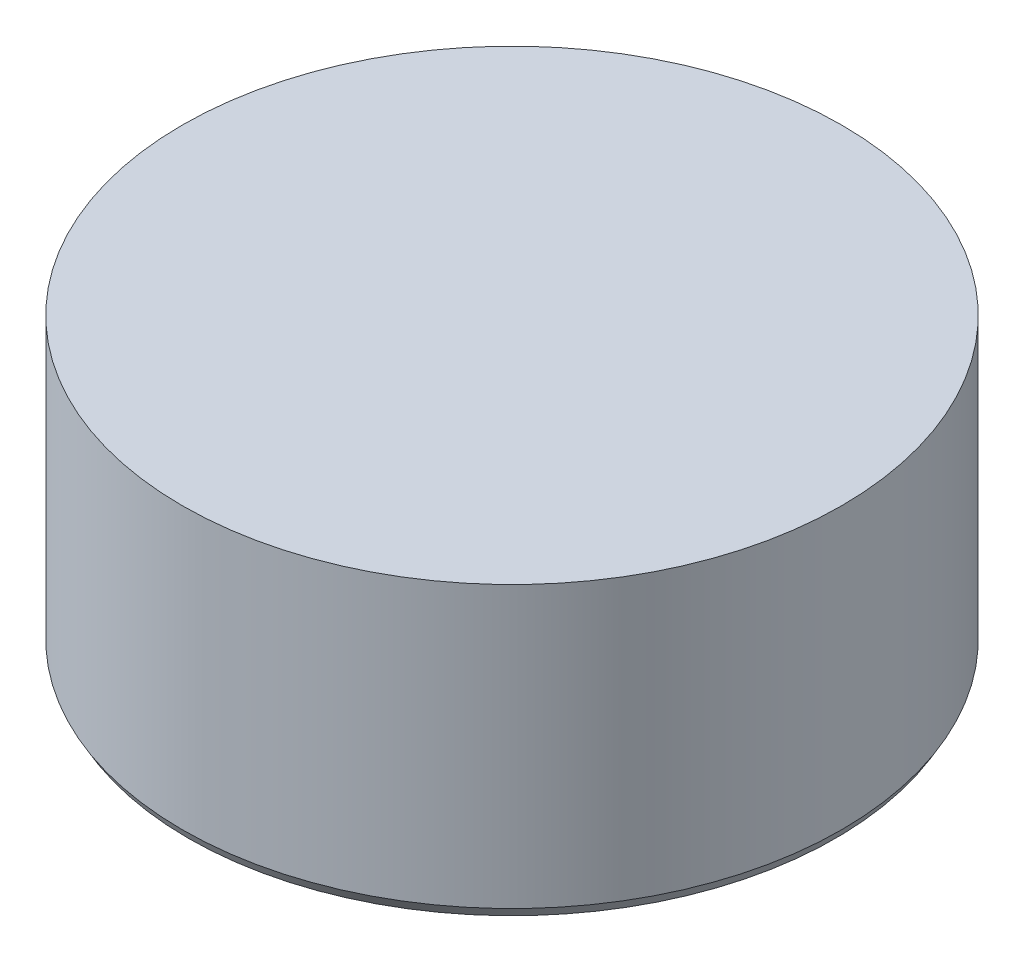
ISO-10303-21;
HEADER;
FILE_DESCRIPTION(('STEP AP214'),'2;1');
FILE_NAME('part.step','',(''),(''),'','','');
FILE_SCHEMA(('AUTOMOTIVE_DESIGN { 1 0 10303 214 1 1 1 1 }'));
ENDSEC;
DATA;
#1=APPLICATION_CONTEXT('core data for automotive mechanical design processes');
#2=APPLICATION_PROTOCOL_DEFINITION('international standard','automotive_design',2000,#1);
#3=PRODUCT_CONTEXT('',#1,'mechanical');
#4=PRODUCT('Part','Part','',(#3));
#5=PRODUCT_RELATED_PRODUCT_CATEGORY('part','',(#4));
#6=PRODUCT_DEFINITION_FORMATION('','',#4);
#7=PRODUCT_DEFINITION_CONTEXT('part definition',#1,'design');
#8=PRODUCT_DEFINITION('design','',#6,#7);
#9=PRODUCT_DEFINITION_SHAPE('','',#8);
#10=(LENGTH_UNIT() NAMED_UNIT(*) SI_UNIT(.MILLI.,.METRE.));
#11=(NAMED_UNIT(*) PLANE_ANGLE_UNIT() SI_UNIT($,.RADIAN.));
#12=(NAMED_UNIT(*) SI_UNIT($,.STERADIAN.) SOLID_ANGLE_UNIT());
#13=UNCERTAINTY_MEASURE_WITH_UNIT(LENGTH_MEASURE(1.E-05),#10,'distance_accuracy_value','');
#14=(GEOMETRIC_REPRESENTATION_CONTEXT(3) GLOBAL_UNCERTAINTY_ASSIGNED_CONTEXT((#13)) GLOBAL_UNIT_ASSIGNED_CONTEXT((#10,
#11,#12)) REPRESENTATION_CONTEXT('',''));
#15=CARTESIAN_POINT('',(0.,0.,0.));
#16=DIRECTION('',(0.,0.,1.));
#17=DIRECTION('',(1.,0.,0.));
#18=AXIS2_PLACEMENT_3D('',#15,#16,#17);
#19=CARTESIAN_POINT('',(0.,0.,0.));
#20=DIRECTION('',(0.,-1.,0.));
#21=DIRECTION('',(0.,0.,-1.));
#22=AXIS2_PLACEMENT_3D('',#19,#20,#21);
#23=CYLINDRICAL_SURFACE('',#22,3.5814);
#24=CARTESIAN_POINT('',(0.,-0.508,0.));
#25=DIRECTION('',(0.,-1.,0.));
#26=DIRECTION('',(0.,0.,-1.));
#27=AXIS2_PLACEMENT_3D('',#24,#25,#26);
#28=CIRCLE('',#27,3.5814);
#29=CARTESIAN_POINT('',(0.,-0.508,-3.5814));
#30=VERTEX_POINT('',#29);
#31=EDGE_CURVE('E11',#30,#30,#28,.T.);
#32=ORIENTED_EDGE('',*,*,#31,.T.);
#33=EDGE_LOOP('',(#32));
#34=FACE_BOUND('',#33,.T.);
#35=CARTESIAN_POINT('',(0.,-3.556,0.));
#36=DIRECTION('',(0.,-1.,0.));
#37=DIRECTION('',(0.,0.,-1.));
#38=AXIS2_PLACEMENT_3D('',#35,#36,#37);
#39=CIRCLE('',#38,3.5814);
#40=CARTESIAN_POINT('',(0.,-3.556,-3.5814));
#41=VERTEX_POINT('',#40);
#42=EDGE_CURVE('E51',#41,#41,#39,.T.);
#43=ORIENTED_EDGE('',*,*,#42,.F.);
#44=EDGE_LOOP('',(#43));
#45=FACE_BOUND('',#44,.T.);
#46=ADVANCED_FACE('F34',(#34,#45),#23,.T.);
#47=CARTESIAN_POINT('',(0.,-0.508,0.));
#48=DIRECTION('',(0.,1.,0.));
#49=DIRECTION('',(0.,0.,1.));
#50=AXIS2_PLACEMENT_3D('',#47,#48,#49);
#51=PLANE('',#50);
#52=ORIENTED_EDGE('',*,*,#31,.F.);
#53=EDGE_LOOP('',(#52));
#54=FACE_BOUND('',#53,.T.);
#55=ADVANCED_FACE('F63',(#54),#51,.T.);
#56=CARTESIAN_POINT('',(0.,-3.81,0.));
#57=DIRECTION('',(0.,1.,0.));
#58=DIRECTION('',(0.,0.,1.));
#59=AXIS2_PLACEMENT_3D('',#56,#57,#58);
#60=CONICAL_SURFACE('',#59,3.43475303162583,0.523598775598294);
#61=ORIENTED_EDGE('',*,*,#42,.T.);
#62=EDGE_LOOP('',(#61));
#63=FACE_BOUND('',#62,.T.);
#64=CARTESIAN_POINT('',(0.,-3.67011814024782,0.));
#65=DIRECTION('',(0.,1.,0.));
#66=DIRECTION('',(0.,0.,1.));
#67=AXIS2_PLACEMENT_3D('',#64,#65,#66);
#68=CIRCLE('',#67,3.5155138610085);
#69=CARTESIAN_POINT('',(0.,-3.67011814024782,3.5155138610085));
#70=VERTEX_POINT('',#69);
#71=EDGE_CURVE('E37',#70,#70,#68,.T.);
#72=ORIENTED_EDGE('',*,*,#71,.T.);
#73=EDGE_LOOP('',(#72));
#74=FACE_BOUND('',#73,.T.);
#75=ADVANCED_FACE('F47',(#63,#74),#60,.T.);
#76=CARTESIAN_POINT('',(0.,-3.429,0.));
#77=CARTESIAN_POINT('',(-3.45166114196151,-3.42220998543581,0.));
#78=CARTESIAN_POINT('',(-3.45412993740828,-3.47439267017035,0.));
#79=CARTESIAN_POINT('',(-3.5814,-3.81,0.));
#80=B_SPLINE_CURVE_WITH_KNOTS('',3,(#76,#77,#78,#79),.UNSPECIFIED.,.F.,.F.,(4,4),(0.,
0.524614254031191),.UNSPECIFIED.);
#81=CARTESIAN_POINT('',(0.,-3.81,0.));
#82=DIRECTION('',(0.,1.,0.));
#83=AXIS1_PLACEMENT('',#81,#82);
#84=SURFACE_OF_REVOLUTION('',#80,#83);
#85=CARTESIAN_POINT('',(0.,-3.429,0.));
#86=VERTEX_POINT('',#85);
#87=VERTEX_LOOP('',#86);
#88=FACE_BOUND('',#87,.T.);
#89=ORIENTED_EDGE('',*,*,#71,.F.);
#90=EDGE_LOOP('',(#89));
#91=FACE_BOUND('',#90,.T.);
#92=ADVANCED_FACE('F44',(#88,#91),#84,.T.);
#93=CLOSED_SHELL('',(#46,#55,#75,#92));
#94=MANIFOLD_SOLID_BREP('B2',#93);
#95=ADVANCED_BREP_SHAPE_REPRESENTATION('',(#18,#94),#14);
#96=SHAPE_DEFINITION_REPRESENTATION(#9,#95);
ENDSEC;
END-ISO-10303-21;
